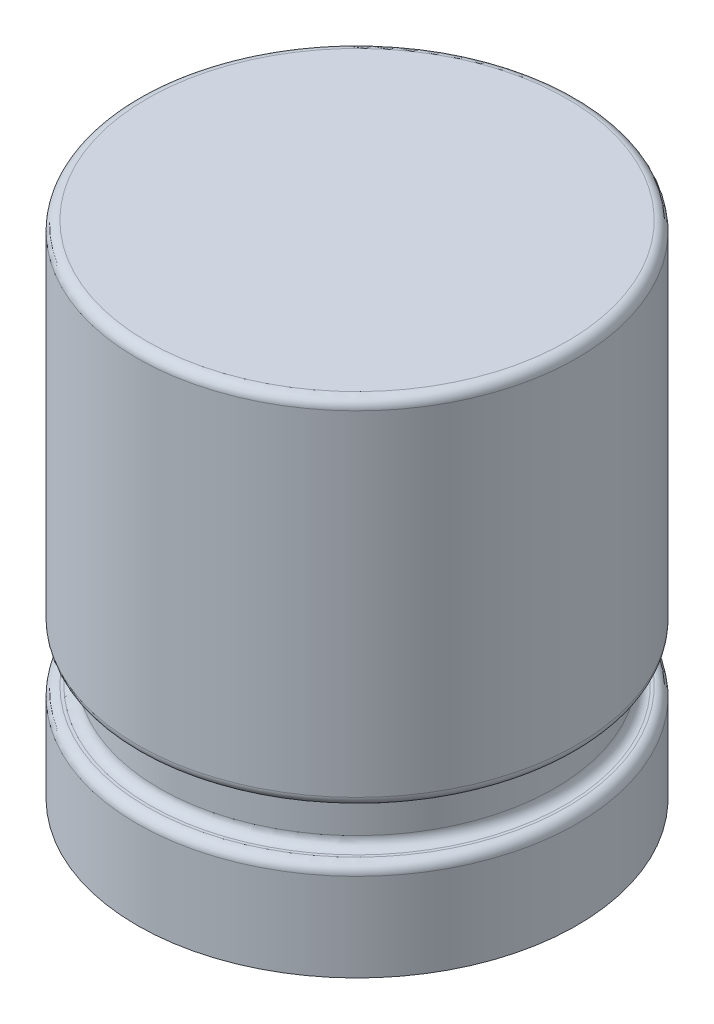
from build123d import *

# Parameters (mm, degrees)
CROQUIS1_R              = 1.8
SALIENTE_EXTRUIR1_DEPTH = 0.8
CROQUIS2_R              = 1.617310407
SALIENTE_EXTRUIR2_DEPTH = 0.4
CROQUIS3_R              = 1.8
SALIENTE_EXTRUIR3_DEPTH = 2.9
REDONDEO3_R             = 0.08
REDONDEO4_R             = 0.08


with BuildPart() as part:
    # Croquis1 → Saliente-Extruir1 (new body)
    with BuildSketch(Plane(origin=(0, 0, 0), x_dir=(1, 0, 0), z_dir=(0, 1, 0))):
        with Locations(Location((0, 0, 0), (0, 0, 270))):
            Circle(CROQUIS1_R)
    extrude(amount=SALIENTE_EXTRUIR1_DEPTH)

    # Croquis2 → Saliente-Extruir2 (add)
    with BuildSketch(Plane(origin=(0, 0.8, 0), x_dir=(1, 0, 0), z_dir=(0, 1, 0))):
        with Locations(Location((0, 0, 0), (0, 0, 270))):
            Circle(CROQUIS2_R)
    extrude(amount=SALIENTE_EXTRUIR2_DEPTH)

    # Croquis3 → Saliente-Extruir3 (add)
    with BuildSketch(Plane(origin=(0, 1.2, 0), x_dir=(1, 0, 0), z_dir=(0, 1, 0))):
        with Locations(Location((0, 0, 0), (0, 0, 270))):
            Circle(CROQUIS3_R)
    extrude(amount=SALIENTE_EXTRUIR3_DEPTH)

    # Redondeo3
    redondeo3_edges = [part.edges().sort_by_distance(p)[0] for p in [
        (0, 0.8, -1.8),
        (0, 0.8, -1.617310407),
        (0, 1.2, -1.617310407),
        (0, 1.2, -1.8),
    ]]
    fillet(redondeo3_edges, radius=REDONDEO3_R)

    # Redondeo4
    redondeo4_edges = [part.edges().sort_by_distance(p)[0] for p in [
        (0, 4.1, -1.8),
    ]]
    fillet(redondeo4_edges, radius=REDONDEO4_R)


solid = part.part
